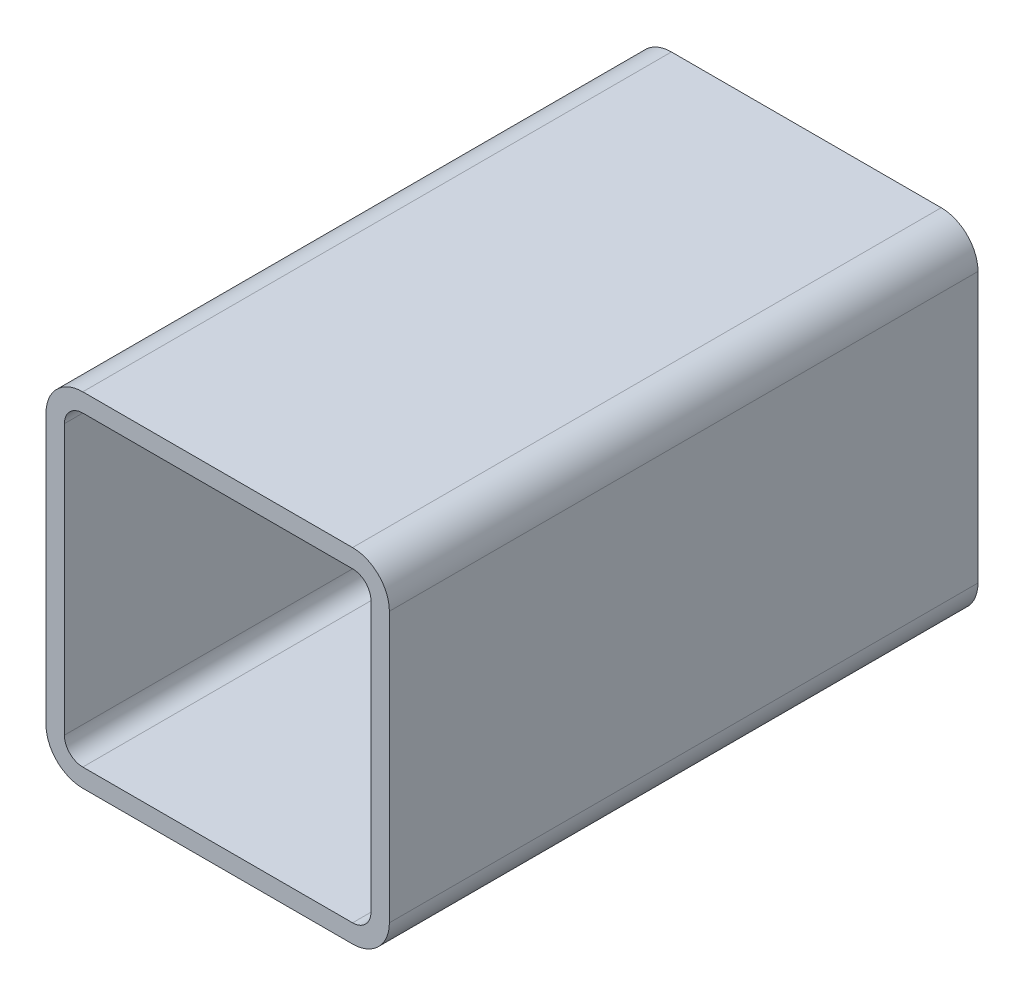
ISO-10303-21;
HEADER;
FILE_DESCRIPTION(('STEP AP214'),'2;1');
FILE_NAME('part.step','',(''),(''),'','','');
FILE_SCHEMA(('AUTOMOTIVE_DESIGN { 1 0 10303 214 1 1 1 1 }'));
ENDSEC;
DATA;
#1=APPLICATION_CONTEXT('core data for automotive mechanical design processes');
#2=APPLICATION_PROTOCOL_DEFINITION('international standard','automotive_design',2000,#1);
#3=PRODUCT_CONTEXT('',#1,'mechanical');
#4=PRODUCT('Part','Part','',(#3));
#5=PRODUCT_RELATED_PRODUCT_CATEGORY('part','',(#4));
#6=PRODUCT_DEFINITION_FORMATION('','',#4);
#7=PRODUCT_DEFINITION_CONTEXT('part definition',#1,'design');
#8=PRODUCT_DEFINITION('design','',#6,#7);
#9=PRODUCT_DEFINITION_SHAPE('','',#8);
#10=(LENGTH_UNIT() NAMED_UNIT(*) SI_UNIT(.MILLI.,.METRE.));
#11=(NAMED_UNIT(*) PLANE_ANGLE_UNIT() SI_UNIT($,.RADIAN.));
#12=(NAMED_UNIT(*) SI_UNIT($,.STERADIAN.) SOLID_ANGLE_UNIT());
#13=UNCERTAINTY_MEASURE_WITH_UNIT(LENGTH_MEASURE(1.E-05),#10,'distance_accuracy_value','');
#14=(GEOMETRIC_REPRESENTATION_CONTEXT(3) GLOBAL_UNCERTAINTY_ASSIGNED_CONTEXT((#13)) GLOBAL_UNIT_ASSIGNED_CONTEXT((#10,
#11,#12)) REPRESENTATION_CONTEXT('',''));
#15=CARTESIAN_POINT('',(0.,0.,0.));
#16=DIRECTION('',(0.,0.,1.));
#17=DIRECTION('',(1.,0.,0.));
#18=AXIS2_PLACEMENT_3D('',#15,#16,#17);
#19=CARTESIAN_POINT('',(21.2548786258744,160.739039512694,304.8));
#20=DIRECTION('',(0.,0.,1.));
#21=DIRECTION('',(1.,0.,0.));
#22=AXIS2_PLACEMENT_3D('',#19,#20,#21);
#23=PLANE('',#22);
#24=CARTESIAN_POINT('',(21.2548786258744,160.739039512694,304.8));
#25=DIRECTION('',(0.,0.,1.));
#26=DIRECTION('',(1.,0.,0.));
#27=AXIS2_PLACEMENT_3D('',#24,#25,#26);
#28=CIRCLE('',#27,19.05);
#29=CARTESIAN_POINT('',(21.2548786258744,179.789039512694,304.8));
#30=VERTEX_POINT('',#29);
#31=CARTESIAN_POINT('',(2.20487862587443,160.739039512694,304.8));
#32=VERTEX_POINT('',#31);
#33=EDGE_CURVE('E211',#30,#32,#28,.T.);
#34=ORIENTED_EDGE('',*,*,#33,.T.);
#35=DIRECTION('',(0.,-1.,0.));
#36=VECTOR('',#35,1.);
#37=CARTESIAN_POINT('',(2.20487862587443,21.0390395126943,304.8));
#38=LINE('',#37,#36);
#39=CARTESIAN_POINT('',(2.20487862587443,21.0390395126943,304.8));
#40=VERTEX_POINT('',#39);
#41=EDGE_CURVE('E214',#32,#40,#38,.T.);
#42=ORIENTED_EDGE('',*,*,#41,.T.);
#43=CARTESIAN_POINT('',(21.2548786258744,21.0390395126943,304.8));
#44=DIRECTION('',(0.,0.,1.));
#45=DIRECTION('',(1.,0.,0.));
#46=AXIS2_PLACEMENT_3D('',#43,#44,#45);
#47=CIRCLE('',#46,19.05);
#48=CARTESIAN_POINT('',(21.2548786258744,1.98903951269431,304.8));
#49=VERTEX_POINT('',#48);
#50=EDGE_CURVE('E217',#40,#49,#47,.T.);
#51=ORIENTED_EDGE('',*,*,#50,.T.);
#52=DIRECTION('',(1.,0.,0.));
#53=VECTOR('',#52,1.);
#54=CARTESIAN_POINT('',(160.954878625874,1.98903951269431,304.8));
#55=LINE('',#54,#53);
#56=CARTESIAN_POINT('',(160.954878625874,1.98903951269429,304.8));
#57=VERTEX_POINT('',#56);
#58=EDGE_CURVE('E219',#49,#57,#55,.T.);
#59=ORIENTED_EDGE('',*,*,#58,.T.);
#60=CARTESIAN_POINT('',(160.954878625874,21.0390395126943,304.8));
#61=DIRECTION('',(0.,0.,1.));
#62=DIRECTION('',(1.,0.,0.));
#63=AXIS2_PLACEMENT_3D('',#60,#61,#62);
#64=CIRCLE('',#63,19.05);
#65=CARTESIAN_POINT('',(180.004878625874,21.0390395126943,304.8));
#66=VERTEX_POINT('',#65);
#67=EDGE_CURVE('E221',#57,#66,#64,.T.);
#68=ORIENTED_EDGE('',*,*,#67,.T.);
#69=DIRECTION('',(0.,1.,0.));
#70=VECTOR('',#69,1.);
#71=CARTESIAN_POINT('',(180.004878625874,160.739039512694,304.8));
#72=LINE('',#71,#70);
#73=CARTESIAN_POINT('',(180.004878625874,160.739039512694,304.8));
#74=VERTEX_POINT('',#73);
#75=EDGE_CURVE('E223',#66,#74,#72,.T.);
#76=ORIENTED_EDGE('',*,*,#75,.T.);
#77=CARTESIAN_POINT('',(160.954878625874,160.739039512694,304.8));
#78=DIRECTION('',(0.,0.,1.));
#79=DIRECTION('',(1.,0.,0.));
#80=AXIS2_PLACEMENT_3D('',#77,#78,#79);
#81=CIRCLE('',#80,19.05);
#82=CARTESIAN_POINT('',(160.954878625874,179.789039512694,304.8));
#83=VERTEX_POINT('',#82);
#84=EDGE_CURVE('E225',#74,#83,#81,.T.);
#85=ORIENTED_EDGE('',*,*,#84,.T.);
#86=DIRECTION('',(-1.,0.,0.));
#87=VECTOR('',#86,1.);
#88=CARTESIAN_POINT('',(21.2548786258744,179.789039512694,304.8));
#89=LINE('',#88,#87);
#90=EDGE_CURVE('E227',#83,#30,#89,.T.);
#91=ORIENTED_EDGE('',*,*,#90,.T.);
#92=EDGE_LOOP('',(#34,#42,#51,#59,#68,#76,#85,#91));
#93=FACE_BOUND('',#92,.T.);
#94=DIRECTION('',(0.,-1.,0.));
#95=VECTOR('',#94,1.);
#96=CARTESIAN_POINT('',(11.7298786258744,21.0390395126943,304.8));
#97=LINE('',#96,#95);
#98=CARTESIAN_POINT('',(11.7298786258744,160.739039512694,304.8));
#99=VERTEX_POINT('',#98);
#100=CARTESIAN_POINT('',(11.7298786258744,21.0390395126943,304.8));
#101=VERTEX_POINT('',#100);
#102=EDGE_CURVE('E154',#99,#101,#97,.T.);
#103=ORIENTED_EDGE('',*,*,#102,.F.);
#104=CARTESIAN_POINT('',(21.2548786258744,160.739039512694,304.8));
#105=DIRECTION('',(0.,0.,1.));
#106=DIRECTION('',(1.,0.,0.));
#107=AXIS2_PLACEMENT_3D('',#104,#105,#106);
#108=CIRCLE('',#107,9.52500000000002);
#109=CARTESIAN_POINT('',(21.2548786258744,170.264039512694,304.8));
#110=VERTEX_POINT('',#109);
#111=EDGE_CURVE('E146',#110,#99,#108,.T.);
#112=ORIENTED_EDGE('',*,*,#111,.F.);
#113=DIRECTION('',(-1.,0.,0.));
#114=VECTOR('',#113,1.);
#115=CARTESIAN_POINT('',(21.2548786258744,170.264039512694,304.8));
#116=LINE('',#115,#114);
#117=CARTESIAN_POINT('',(160.954878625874,170.264039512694,304.8));
#118=VERTEX_POINT('',#117);
#119=EDGE_CURVE('E179',#118,#110,#116,.T.);
#120=ORIENTED_EDGE('',*,*,#119,.F.);
#121=CARTESIAN_POINT('',(160.954878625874,160.739039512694,304.8));
#122=DIRECTION('',(0.,0.,1.));
#123=DIRECTION('',(1.,0.,0.));
#124=AXIS2_PLACEMENT_3D('',#121,#122,#123);
#125=CIRCLE('',#124,9.52500000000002);
#126=CARTESIAN_POINT('',(170.479878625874,160.739039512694,304.8));
#127=VERTEX_POINT('',#126);
#128=EDGE_CURVE('E177',#127,#118,#125,.T.);
#129=ORIENTED_EDGE('',*,*,#128,.F.);
#130=DIRECTION('',(0.,1.,0.));
#131=VECTOR('',#130,1.);
#132=CARTESIAN_POINT('',(170.479878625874,160.739039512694,304.8));
#133=LINE('',#132,#131);
#134=CARTESIAN_POINT('',(170.479878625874,21.0390395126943,304.8));
#135=VERTEX_POINT('',#134);
#136=EDGE_CURVE('E175',#135,#127,#133,.T.);
#137=ORIENTED_EDGE('',*,*,#136,.F.);
#138=CARTESIAN_POINT('',(160.954878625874,21.0390395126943,304.8));
#139=DIRECTION('',(0.,0.,1.));
#140=DIRECTION('',(1.,0.,0.));
#141=AXIS2_PLACEMENT_3D('',#138,#139,#140);
#142=CIRCLE('',#141,9.52500000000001);
#143=CARTESIAN_POINT('',(160.954878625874,11.5140395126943,304.8));
#144=VERTEX_POINT('',#143);
#145=EDGE_CURVE('E173',#144,#135,#142,.T.);
#146=ORIENTED_EDGE('',*,*,#145,.F.);
#147=DIRECTION('',(1.,0.,0.));
#148=VECTOR('',#147,1.);
#149=CARTESIAN_POINT('',(160.954878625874,11.5140395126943,304.8));
#150=LINE('',#149,#148);
#151=CARTESIAN_POINT('',(21.2548786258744,11.5140395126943,304.8));
#152=VERTEX_POINT('',#151);
#153=EDGE_CURVE('E169',#152,#144,#150,.T.);
#154=ORIENTED_EDGE('',*,*,#153,.F.);
#155=CARTESIAN_POINT('',(21.2548786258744,21.0390395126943,304.8));
#156=DIRECTION('',(0.,0.,1.));
#157=DIRECTION('',(1.,0.,0.));
#158=AXIS2_PLACEMENT_3D('',#155,#156,#157);
#159=CIRCLE('',#158,9.525);
#160=EDGE_CURVE('E167',#101,#152,#159,.T.);
#161=ORIENTED_EDGE('',*,*,#160,.F.);
#162=EDGE_LOOP('',(#103,#112,#120,#129,#137,#146,#154,#161));
#163=FACE_BOUND('',#162,.T.);
#164=ADVANCED_FACE('F33',(#93,#163),#23,.T.);
#165=CARTESIAN_POINT('',(21.2548786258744,160.739039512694,0.));
#166=DIRECTION('',(0.,0.,1.));
#167=DIRECTION('',(1.,0.,0.));
#168=AXIS2_PLACEMENT_3D('',#165,#166,#167);
#169=PLANE('',#168);
#170=CARTESIAN_POINT('',(21.2548786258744,160.739039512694,0.));
#171=DIRECTION('',(0.,0.,1.));
#172=DIRECTION('',(1.,0.,0.));
#173=AXIS2_PLACEMENT_3D('',#170,#171,#172);
#174=CIRCLE('',#173,19.05);
#175=CARTESIAN_POINT('',(21.2548786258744,179.789039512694,0.));
#176=VERTEX_POINT('',#175);
#177=CARTESIAN_POINT('',(2.20487862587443,160.739039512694,0.));
#178=VERTEX_POINT('',#177);
#179=EDGE_CURVE('E162',#176,#178,#174,.T.);
#180=ORIENTED_EDGE('',*,*,#179,.F.);
#181=DIRECTION('',(-1.,0.,0.));
#182=VECTOR('',#181,1.);
#183=CARTESIAN_POINT('',(21.2548786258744,179.789039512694,0.));
#184=LINE('',#183,#182);
#185=CARTESIAN_POINT('',(160.954878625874,179.789039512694,0.));
#186=VERTEX_POINT('',#185);
#187=EDGE_CURVE('E215',#186,#176,#184,.T.);
#188=ORIENTED_EDGE('',*,*,#187,.F.);
#189=CARTESIAN_POINT('',(160.954878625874,160.739039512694,0.));
#190=DIRECTION('',(0.,0.,1.));
#191=DIRECTION('',(1.,0.,0.));
#192=AXIS2_PLACEMENT_3D('',#189,#190,#191);
#193=CIRCLE('',#192,19.05);
#194=CARTESIAN_POINT('',(180.004878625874,160.739039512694,0.));
#195=VERTEX_POINT('',#194);
#196=EDGE_CURVE('E242',#195,#186,#193,.T.);
#197=ORIENTED_EDGE('',*,*,#196,.F.);
#198=DIRECTION('',(0.,1.,0.));
#199=VECTOR('',#198,1.);
#200=CARTESIAN_POINT('',(180.004878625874,160.739039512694,0.));
#201=LINE('',#200,#199);
#202=CARTESIAN_POINT('',(180.004878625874,21.0390395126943,0.));
#203=VERTEX_POINT('',#202);
#204=EDGE_CURVE('E240',#203,#195,#201,.T.);
#205=ORIENTED_EDGE('',*,*,#204,.F.);
#206=CARTESIAN_POINT('',(160.954878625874,21.0390395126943,0.));
#207=DIRECTION('',(0.,0.,1.));
#208=DIRECTION('',(1.,0.,0.));
#209=AXIS2_PLACEMENT_3D('',#206,#207,#208);
#210=CIRCLE('',#209,19.05);
#211=CARTESIAN_POINT('',(160.954878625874,1.98903951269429,0.));
#212=VERTEX_POINT('',#211);
#213=EDGE_CURVE('E238',#212,#203,#210,.T.);
#214=ORIENTED_EDGE('',*,*,#213,.F.);
#215=DIRECTION('',(1.,0.,0.));
#216=VECTOR('',#215,1.);
#217=CARTESIAN_POINT('',(160.954878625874,1.98903951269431,0.));
#218=LINE('',#217,#216);
#219=CARTESIAN_POINT('',(21.2548786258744,1.98903951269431,0.));
#220=VERTEX_POINT('',#219);
#221=EDGE_CURVE('E236',#220,#212,#218,.T.);
#222=ORIENTED_EDGE('',*,*,#221,.F.);
#223=CARTESIAN_POINT('',(21.2548786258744,21.0390395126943,0.));
#224=DIRECTION('',(0.,0.,1.));
#225=DIRECTION('',(1.,0.,0.));
#226=AXIS2_PLACEMENT_3D('',#223,#224,#225);
#227=CIRCLE('',#226,19.05);
#228=CARTESIAN_POINT('',(2.20487862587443,21.0390395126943,0.));
#229=VERTEX_POINT('',#228);
#230=EDGE_CURVE('E234',#229,#220,#227,.T.);
#231=ORIENTED_EDGE('',*,*,#230,.F.);
#232=DIRECTION('',(0.,-1.,0.));
#233=VECTOR('',#232,1.);
#234=CARTESIAN_POINT('',(2.20487862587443,21.0390395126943,0.));
#235=LINE('',#234,#233);
#236=EDGE_CURVE('E232',#178,#229,#235,.T.);
#237=ORIENTED_EDGE('',*,*,#236,.F.);
#238=EDGE_LOOP('',(#180,#188,#197,#205,#214,#222,#231,#237));
#239=FACE_BOUND('',#238,.T.);
#240=CARTESIAN_POINT('',(21.2548786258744,160.739039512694,0.));
#241=DIRECTION('',(0.,0.,1.));
#242=DIRECTION('',(1.,0.,0.));
#243=AXIS2_PLACEMENT_3D('',#240,#241,#242);
#244=CIRCLE('',#243,9.52500000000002);
#245=CARTESIAN_POINT('',(21.2548786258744,170.264039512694,0.));
#246=VERTEX_POINT('',#245);
#247=CARTESIAN_POINT('',(11.7298786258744,160.739039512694,0.));
#248=VERTEX_POINT('',#247);
#249=EDGE_CURVE('E56',#246,#248,#244,.T.);
#250=ORIENTED_EDGE('',*,*,#249,.T.);
#251=DIRECTION('',(0.,-1.,0.));
#252=VECTOR('',#251,1.);
#253=CARTESIAN_POINT('',(11.7298786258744,21.0390395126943,0.));
#254=LINE('',#253,#252);
#255=CARTESIAN_POINT('',(11.7298786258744,21.0390395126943,0.));
#256=VERTEX_POINT('',#255);
#257=EDGE_CURVE('E161',#248,#256,#254,.T.);
#258=ORIENTED_EDGE('',*,*,#257,.T.);
#259=CARTESIAN_POINT('',(21.2548786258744,21.0390395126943,0.));
#260=DIRECTION('',(0.,0.,1.));
#261=DIRECTION('',(1.,0.,0.));
#262=AXIS2_PLACEMENT_3D('',#259,#260,#261);
#263=CIRCLE('',#262,9.525);
#264=CARTESIAN_POINT('',(21.2548786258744,11.5140395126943,0.));
#265=VERTEX_POINT('',#264);
#266=EDGE_CURVE('E183',#256,#265,#263,.T.);
#267=ORIENTED_EDGE('',*,*,#266,.T.);
#268=DIRECTION('',(1.,0.,0.));
#269=VECTOR('',#268,1.);
#270=CARTESIAN_POINT('',(160.954878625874,11.5140395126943,0.));
#271=LINE('',#270,#269);
#272=CARTESIAN_POINT('',(160.954878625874,11.5140395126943,0.));
#273=VERTEX_POINT('',#272);
#274=EDGE_CURVE('E186',#265,#273,#271,.T.);
#275=ORIENTED_EDGE('',*,*,#274,.T.);
#276=CARTESIAN_POINT('',(160.954878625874,21.0390395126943,0.));
#277=DIRECTION('',(0.,0.,1.));
#278=DIRECTION('',(1.,0.,0.));
#279=AXIS2_PLACEMENT_3D('',#276,#277,#278);
#280=CIRCLE('',#279,9.52500000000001);
#281=CARTESIAN_POINT('',(170.479878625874,21.0390395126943,0.));
#282=VERTEX_POINT('',#281);
#283=EDGE_CURVE('E189',#273,#282,#280,.T.);
#284=ORIENTED_EDGE('',*,*,#283,.T.);
#285=DIRECTION('',(0.,1.,0.));
#286=VECTOR('',#285,1.);
#287=CARTESIAN_POINT('',(170.479878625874,160.739039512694,0.));
#288=LINE('',#287,#286);
#289=CARTESIAN_POINT('',(170.479878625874,160.739039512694,0.));
#290=VERTEX_POINT('',#289);
#291=EDGE_CURVE('E192',#282,#290,#288,.T.);
#292=ORIENTED_EDGE('',*,*,#291,.T.);
#293=CARTESIAN_POINT('',(160.954878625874,160.739039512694,0.));
#294=DIRECTION('',(0.,0.,1.));
#295=DIRECTION('',(1.,0.,0.));
#296=AXIS2_PLACEMENT_3D('',#293,#294,#295);
#297=CIRCLE('',#296,9.52500000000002);
#298=CARTESIAN_POINT('',(160.954878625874,170.264039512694,0.));
#299=VERTEX_POINT('',#298);
#300=EDGE_CURVE('E195',#290,#299,#297,.T.);
#301=ORIENTED_EDGE('',*,*,#300,.T.);
#302=DIRECTION('',(-1.,0.,0.));
#303=VECTOR('',#302,1.);
#304=CARTESIAN_POINT('',(21.2548786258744,170.264039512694,0.));
#305=LINE('',#304,#303);
#306=EDGE_CURVE('E155',#299,#246,#305,.T.);
#307=ORIENTED_EDGE('',*,*,#306,.T.);
#308=EDGE_LOOP('',(#250,#258,#267,#275,#284,#292,#301,#307));
#309=FACE_BOUND('',#308,.T.);
#310=ADVANCED_FACE('F272',(#239,#309),#169,.F.);
#311=CARTESIAN_POINT('',(21.2548786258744,160.739039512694,304.8));
#312=DIRECTION('',(0.,0.,-1.));
#313=DIRECTION('',(-1.,0.,0.));
#314=AXIS2_PLACEMENT_3D('',#311,#312,#313);
#315=CYLINDRICAL_SURFACE('',#314,19.05);
#316=ORIENTED_EDGE('',*,*,#179,.T.);
#317=DIRECTION('',(0.,0.,-1.));
#318=VECTOR('',#317,1.);
#319=CARTESIAN_POINT('',(2.20487862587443,160.739039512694,304.8));
#320=LINE('',#319,#318);
#321=EDGE_CURVE('E11',#32,#178,#320,.T.);
#322=ORIENTED_EDGE('',*,*,#321,.F.);
#323=ORIENTED_EDGE('',*,*,#33,.F.);
#324=DIRECTION('',(0.,0.,-1.));
#325=VECTOR('',#324,1.);
#326=CARTESIAN_POINT('',(21.2548786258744,179.789039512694,304.8));
#327=LINE('',#326,#325);
#328=EDGE_CURVE('E229',#30,#176,#327,.T.);
#329=ORIENTED_EDGE('',*,*,#328,.T.);
#330=EDGE_LOOP('',(#316,#322,#323,#329));
#331=FACE_BOUND('',#330,.T.);
#332=ADVANCED_FACE('F35',(#331),#315,.T.);
#333=CARTESIAN_POINT('',(2.20487862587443,21.0390395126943,304.8));
#334=DIRECTION('',(1.,0.,0.));
#335=DIRECTION('',(0.,0.,-1.));
#336=AXIS2_PLACEMENT_3D('',#333,#334,#335);
#337=PLANE('',#336);
#338=ORIENTED_EDGE('',*,*,#236,.T.);
#339=DIRECTION('',(0.,0.,-1.));
#340=VECTOR('',#339,1.);
#341=CARTESIAN_POINT('',(2.20487862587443,21.0390395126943,304.8));
#342=LINE('',#341,#340);
#343=EDGE_CURVE('E41',#40,#229,#342,.T.);
#344=ORIENTED_EDGE('',*,*,#343,.F.);
#345=ORIENTED_EDGE('',*,*,#41,.F.);
#346=ORIENTED_EDGE('',*,*,#321,.T.);
#347=EDGE_LOOP('',(#338,#344,#345,#346));
#348=FACE_BOUND('',#347,.T.);
#349=ADVANCED_FACE('F289',(#348),#337,.F.);
#350=CARTESIAN_POINT('',(21.2548786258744,21.0390395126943,304.8));
#351=DIRECTION('',(0.,0.,-1.));
#352=DIRECTION('',(-1.,0.,0.));
#353=AXIS2_PLACEMENT_3D('',#350,#351,#352);
#354=CYLINDRICAL_SURFACE('',#353,19.05);
#355=ORIENTED_EDGE('',*,*,#230,.T.);
#356=DIRECTION('',(0.,0.,-1.));
#357=VECTOR('',#356,1.);
#358=CARTESIAN_POINT('',(21.2548786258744,1.98903951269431,304.8));
#359=LINE('',#358,#357);
#360=EDGE_CURVE('E259',#49,#220,#359,.T.);
#361=ORIENTED_EDGE('',*,*,#360,.F.);
#362=ORIENTED_EDGE('',*,*,#50,.F.);
#363=ORIENTED_EDGE('',*,*,#343,.T.);
#364=EDGE_LOOP('',(#355,#361,#362,#363));
#365=FACE_BOUND('',#364,.T.);
#366=ADVANCED_FACE('F266',(#365),#354,.T.);
#367=CARTESIAN_POINT('',(160.954878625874,1.98903951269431,304.8));
#368=DIRECTION('',(0.,1.,0.));
#369=DIRECTION('',(0.,0.,1.));
#370=AXIS2_PLACEMENT_3D('',#367,#368,#369);
#371=PLANE('',#370);
#372=ORIENTED_EDGE('',*,*,#221,.T.);
#373=DIRECTION('',(0.,0.,-1.));
#374=VECTOR('',#373,1.);
#375=CARTESIAN_POINT('',(160.954878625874,1.98903951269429,304.8));
#376=LINE('',#375,#374);
#377=EDGE_CURVE('E256',#57,#212,#376,.T.);
#378=ORIENTED_EDGE('',*,*,#377,.F.);
#379=ORIENTED_EDGE('',*,*,#58,.F.);
#380=ORIENTED_EDGE('',*,*,#360,.T.);
#381=EDGE_LOOP('',(#372,#378,#379,#380));
#382=FACE_BOUND('',#381,.T.);
#383=ADVANCED_FACE('F278',(#382),#371,.F.);
#384=CARTESIAN_POINT('',(160.954878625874,21.0390395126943,304.8));
#385=DIRECTION('',(0.,0.,-1.));
#386=DIRECTION('',(-1.,0.,0.));
#387=AXIS2_PLACEMENT_3D('',#384,#385,#386);
#388=CYLINDRICAL_SURFACE('',#387,19.05);
#389=ORIENTED_EDGE('',*,*,#213,.T.);
#390=DIRECTION('',(0.,0.,-1.));
#391=VECTOR('',#390,1.);
#392=CARTESIAN_POINT('',(180.004878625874,21.0390395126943,304.8));
#393=LINE('',#392,#391);
#394=EDGE_CURVE('E253',#66,#203,#393,.T.);
#395=ORIENTED_EDGE('',*,*,#394,.F.);
#396=ORIENTED_EDGE('',*,*,#67,.F.);
#397=ORIENTED_EDGE('',*,*,#377,.T.);
#398=EDGE_LOOP('',(#389,#395,#396,#397));
#399=FACE_BOUND('',#398,.T.);
#400=ADVANCED_FACE('F282',(#399),#388,.T.);
#401=CARTESIAN_POINT('',(180.004878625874,160.739039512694,304.8));
#402=DIRECTION('',(-1.,0.,0.));
#403=DIRECTION('',(0.,0.,1.));
#404=AXIS2_PLACEMENT_3D('',#401,#402,#403);
#405=PLANE('',#404);
#406=ORIENTED_EDGE('',*,*,#204,.T.);
#407=DIRECTION('',(0.,0.,-1.));
#408=VECTOR('',#407,1.);
#409=CARTESIAN_POINT('',(180.004878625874,160.739039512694,304.8));
#410=LINE('',#409,#408);
#411=EDGE_CURVE('E250',#74,#195,#410,.T.);
#412=ORIENTED_EDGE('',*,*,#411,.F.);
#413=ORIENTED_EDGE('',*,*,#75,.F.);
#414=ORIENTED_EDGE('',*,*,#394,.T.);
#415=EDGE_LOOP('',(#406,#412,#413,#414));
#416=FACE_BOUND('',#415,.T.);
#417=ADVANCED_FACE('F302',(#416),#405,.F.);
#418=CARTESIAN_POINT('',(160.954878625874,160.739039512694,304.8));
#419=DIRECTION('',(0.,0.,-1.));
#420=DIRECTION('',(-1.,0.,0.));
#421=AXIS2_PLACEMENT_3D('',#418,#419,#420);
#422=CYLINDRICAL_SURFACE('',#421,19.05);
#423=ORIENTED_EDGE('',*,*,#196,.T.);
#424=DIRECTION('',(0.,0.,-1.));
#425=VECTOR('',#424,1.);
#426=CARTESIAN_POINT('',(160.954878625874,179.789039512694,304.8));
#427=LINE('',#426,#425);
#428=EDGE_CURVE('E247',#83,#186,#427,.T.);
#429=ORIENTED_EDGE('',*,*,#428,.F.);
#430=ORIENTED_EDGE('',*,*,#84,.F.);
#431=ORIENTED_EDGE('',*,*,#411,.T.);
#432=EDGE_LOOP('',(#423,#429,#430,#431));
#433=FACE_BOUND('',#432,.T.);
#434=ADVANCED_FACE('F300',(#433),#422,.T.);
#435=CARTESIAN_POINT('',(21.2548786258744,179.789039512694,304.8));
#436=DIRECTION('',(0.,-1.,0.));
#437=DIRECTION('',(0.,0.,-1.));
#438=AXIS2_PLACEMENT_3D('',#435,#436,#437);
#439=PLANE('',#438);
#440=ORIENTED_EDGE('',*,*,#187,.T.);
#441=ORIENTED_EDGE('',*,*,#328,.F.);
#442=ORIENTED_EDGE('',*,*,#90,.F.);
#443=ORIENTED_EDGE('',*,*,#428,.T.);
#444=EDGE_LOOP('',(#440,#441,#442,#443));
#445=FACE_BOUND('',#444,.T.);
#446=ADVANCED_FACE('F295',(#445),#439,.F.);
#447=CARTESIAN_POINT('',(21.2548786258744,160.739039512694,304.8));
#448=DIRECTION('',(0.,0.,-1.));
#449=DIRECTION('',(-1.,0.,0.));
#450=AXIS2_PLACEMENT_3D('',#447,#448,#449);
#451=CYLINDRICAL_SURFACE('',#450,9.52500000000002);
#452=ORIENTED_EDGE('',*,*,#249,.F.);
#453=DIRECTION('',(0.,0.,-1.));
#454=VECTOR('',#453,1.);
#455=CARTESIAN_POINT('',(21.2548786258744,170.264039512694,304.8));
#456=LINE('',#455,#454);
#457=EDGE_CURVE('E150',#110,#246,#456,.T.);
#458=ORIENTED_EDGE('',*,*,#457,.F.);
#459=ORIENTED_EDGE('',*,*,#111,.T.);
#460=DIRECTION('',(0.,0.,-1.));
#461=VECTOR('',#460,1.);
#462=CARTESIAN_POINT('',(11.7298786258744,160.739039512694,304.8));
#463=LINE('',#462,#461);
#464=EDGE_CURVE('E149',#99,#248,#463,.T.);
#465=ORIENTED_EDGE('',*,*,#464,.T.);
#466=EDGE_LOOP('',(#452,#458,#459,#465));
#467=FACE_BOUND('',#466,.T.);
#468=ADVANCED_FACE('F148',(#467),#451,.F.);
#469=CARTESIAN_POINT('',(11.7298786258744,21.0390395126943,304.8));
#470=DIRECTION('',(1.,0.,0.));
#471=DIRECTION('',(0.,0.,-1.));
#472=AXIS2_PLACEMENT_3D('',#469,#470,#471);
#473=PLANE('',#472);
#474=ORIENTED_EDGE('',*,*,#257,.F.);
#475=ORIENTED_EDGE('',*,*,#464,.F.);
#476=ORIENTED_EDGE('',*,*,#102,.T.);
#477=DIRECTION('',(0.,0.,-1.));
#478=VECTOR('',#477,1.);
#479=CARTESIAN_POINT('',(11.7298786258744,21.0390395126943,304.8));
#480=LINE('',#479,#478);
#481=EDGE_CURVE('E163',#101,#256,#480,.T.);
#482=ORIENTED_EDGE('',*,*,#481,.T.);
#483=EDGE_LOOP('',(#474,#475,#476,#482));
#484=FACE_BOUND('',#483,.T.);
#485=ADVANCED_FACE('F158',(#484),#473,.T.);
#486=CARTESIAN_POINT('',(21.2548786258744,21.0390395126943,304.8));
#487=DIRECTION('',(0.,0.,-1.));
#488=DIRECTION('',(-1.,0.,0.));
#489=AXIS2_PLACEMENT_3D('',#486,#487,#488);
#490=CYLINDRICAL_SURFACE('',#489,9.525);
#491=ORIENTED_EDGE('',*,*,#266,.F.);
#492=ORIENTED_EDGE('',*,*,#481,.F.);
#493=ORIENTED_EDGE('',*,*,#160,.T.);
#494=DIRECTION('',(0.,0.,-1.));
#495=VECTOR('',#494,1.);
#496=CARTESIAN_POINT('',(21.2548786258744,11.5140395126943,304.8));
#497=LINE('',#496,#495);
#498=EDGE_CURVE('E208',#152,#265,#497,.T.);
#499=ORIENTED_EDGE('',*,*,#498,.T.);
#500=EDGE_LOOP('',(#491,#492,#493,#499));
#501=FACE_BOUND('',#500,.T.);
#502=ADVANCED_FACE('F327',(#501),#490,.F.);
#503=CARTESIAN_POINT('',(160.954878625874,11.5140395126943,304.8));
#504=DIRECTION('',(0.,1.,0.));
#505=DIRECTION('',(0.,0.,1.));
#506=AXIS2_PLACEMENT_3D('',#503,#504,#505);
#507=PLANE('',#506);
#508=ORIENTED_EDGE('',*,*,#274,.F.);
#509=ORIENTED_EDGE('',*,*,#498,.F.);
#510=ORIENTED_EDGE('',*,*,#153,.T.);
#511=DIRECTION('',(0.,0.,-1.));
#512=VECTOR('',#511,1.);
#513=CARTESIAN_POINT('',(160.954878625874,11.5140395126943,304.8));
#514=LINE('',#513,#512);
#515=EDGE_CURVE('E206',#144,#273,#514,.T.);
#516=ORIENTED_EDGE('',*,*,#515,.T.);
#517=EDGE_LOOP('',(#508,#509,#510,#516));
#518=FACE_BOUND('',#517,.T.);
#519=ADVANCED_FACE('F331',(#518),#507,.T.);
#520=CARTESIAN_POINT('',(160.954878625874,21.0390395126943,304.8));
#521=DIRECTION('',(0.,0.,-1.));
#522=DIRECTION('',(-1.,0.,0.));
#523=AXIS2_PLACEMENT_3D('',#520,#521,#522);
#524=CYLINDRICAL_SURFACE('',#523,9.52500000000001);
#525=ORIENTED_EDGE('',*,*,#283,.F.);
#526=ORIENTED_EDGE('',*,*,#515,.F.);
#527=ORIENTED_EDGE('',*,*,#145,.T.);
#528=DIRECTION('',(0.,0.,-1.));
#529=VECTOR('',#528,1.);
#530=CARTESIAN_POINT('',(170.479878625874,21.0390395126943,304.8));
#531=LINE('',#530,#529);
#532=EDGE_CURVE('E204',#135,#282,#531,.T.);
#533=ORIENTED_EDGE('',*,*,#532,.T.);
#534=EDGE_LOOP('',(#525,#526,#527,#533));
#535=FACE_BOUND('',#534,.T.);
#536=ADVANCED_FACE('F337',(#535),#524,.F.);
#537=CARTESIAN_POINT('',(170.479878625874,160.739039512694,304.8));
#538=DIRECTION('',(-1.,0.,0.));
#539=DIRECTION('',(0.,0.,1.));
#540=AXIS2_PLACEMENT_3D('',#537,#538,#539);
#541=PLANE('',#540);
#542=ORIENTED_EDGE('',*,*,#291,.F.);
#543=ORIENTED_EDGE('',*,*,#532,.F.);
#544=ORIENTED_EDGE('',*,*,#136,.T.);
#545=DIRECTION('',(0.,0.,-1.));
#546=VECTOR('',#545,1.);
#547=CARTESIAN_POINT('',(170.479878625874,160.739039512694,304.8));
#548=LINE('',#547,#546);
#549=EDGE_CURVE('E202',#127,#290,#548,.T.);
#550=ORIENTED_EDGE('',*,*,#549,.T.);
#551=EDGE_LOOP('',(#542,#543,#544,#550));
#552=FACE_BOUND('',#551,.T.);
#553=ADVANCED_FACE('F341',(#552),#541,.T.);
#554=CARTESIAN_POINT('',(160.954878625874,160.739039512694,304.8));
#555=DIRECTION('',(0.,0.,-1.));
#556=DIRECTION('',(-1.,0.,0.));
#557=AXIS2_PLACEMENT_3D('',#554,#555,#556);
#558=CYLINDRICAL_SURFACE('',#557,9.52500000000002);
#559=ORIENTED_EDGE('',*,*,#300,.F.);
#560=ORIENTED_EDGE('',*,*,#549,.F.);
#561=ORIENTED_EDGE('',*,*,#128,.T.);
#562=DIRECTION('',(0.,0.,-1.));
#563=VECTOR('',#562,1.);
#564=CARTESIAN_POINT('',(160.954878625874,170.264039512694,304.8));
#565=LINE('',#564,#563);
#566=EDGE_CURVE('E48',#118,#299,#565,.T.);
#567=ORIENTED_EDGE('',*,*,#566,.T.);
#568=EDGE_LOOP('',(#559,#560,#561,#567));
#569=FACE_BOUND('',#568,.T.);
#570=ADVANCED_FACE('F345',(#569),#558,.F.);
#571=CARTESIAN_POINT('',(21.2548786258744,170.264039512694,304.8));
#572=DIRECTION('',(0.,-1.,0.));
#573=DIRECTION('',(0.,0.,-1.));
#574=AXIS2_PLACEMENT_3D('',#571,#572,#573);
#575=PLANE('',#574);
#576=ORIENTED_EDGE('',*,*,#306,.F.);
#577=ORIENTED_EDGE('',*,*,#566,.F.);
#578=ORIENTED_EDGE('',*,*,#119,.T.);
#579=ORIENTED_EDGE('',*,*,#457,.T.);
#580=EDGE_LOOP('',(#576,#577,#578,#579));
#581=FACE_BOUND('',#580,.T.);
#582=ADVANCED_FACE('F349',(#581),#575,.T.);
#583=CLOSED_SHELL('',(#164,#310,#332,#349,#366,#383,#400,#417,#434,#446,#468,#485,#502,#519,
#536,#553,#570,#582));
#584=MANIFOLD_SOLID_BREP('B2',#583);
#585=ADVANCED_BREP_SHAPE_REPRESENTATION('',(#18,#584),#14);
#586=SHAPE_DEFINITION_REPRESENTATION(#9,#585);
ENDSEC;
END-ISO-10303-21;
